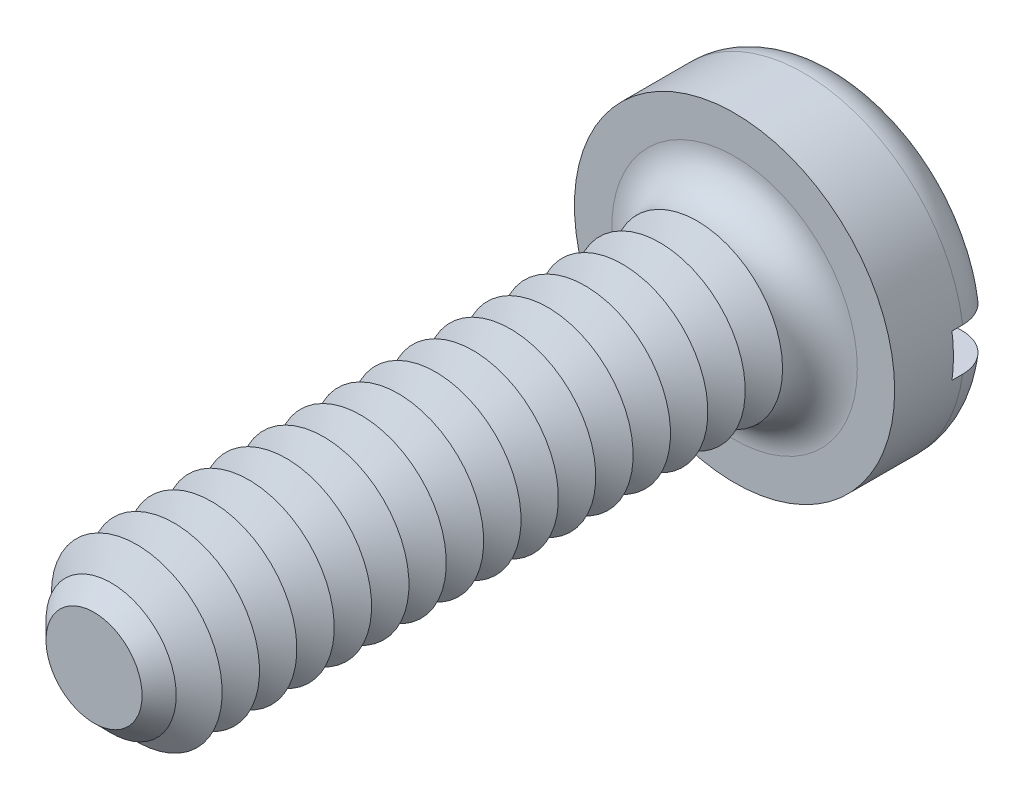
from build123d import *

# Parameters (mm, degrees)
SKETCH3_R           = 1.5
BOSS_EXTRUDE2_DEPTH = 1
SKETCH4_R           = 0.8
BOSS_EXTRUDE3_DEPTH = 6
FILLET1_R           = 0.35
CHAMFER1_SIZE       = 0.35
LPATTERN1_COUNT     = 16
LPATTERN1_PITCH     = 0.35
SKETCH8_W           = 3
SKETCH8_H           = 0.4
CUT_EXTRUDE1_DEPTH  = 0.45


with BuildPart() as part:
    # Sketch3 → Boss-Extrude2 (new body)
    with BuildSketch(Plane.XY):
        Circle(SKETCH3_R)
    extrude(amount=-BOSS_EXTRUDE2_DEPTH)

    # Sketch4 → Boss-Extrude3 (add)
    with BuildSketch(Plane.XY):
        Circle(SKETCH4_R)
    extrude(amount=BOSS_EXTRUDE3_DEPTH)

    # Fillet1
    fillet1_edges = [part.edges().sort_by_distance(p)[0] for p in [
        (-1.5, 0, -1),
        (-0.8, 0, 0),
    ]]
    fillet(fillet1_edges, radius=FILLET1_R)

    # Chamfer1
    chamfer1_edges = [part.edges().sort_by_distance(p)[0] for p in [
        (-0.8, 0, 6),
    ]]
    chamfer(chamfer1_edges, length=CHAMFER1_SIZE)

    # Sketch6 → Cut-Revolve1 (revolve, cut)
    with BuildSketch(Plane(origin=(0, 0, 0), x_dir=(0, 0, -1), z_dir=(1, 0, 0)), mode=Mode.PRIVATE) as cut_revolve1_sk:
        Polygon((-0.35, 0.8), (-0.525, 0.496891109), (-0.7, 0.8), align=None)
    cut_revolve1 = revolve(cut_revolve1_sk.sketch.rotate(Axis((0, 0, -1.694361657), (0, 0, 1)), 90), axis=Axis((0, 0, -1.694361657), (0, 0, 1)), mode=Mode.SUBTRACT)

    # LPattern1: Cut-Revolve1 ×16
    with Locations(*[(0, 0, i * LPATTERN1_PITCH) for i in range(1, LPATTERN1_COUNT)]):
        add(cut_revolve1, mode=Mode.SUBTRACT)

    # Sketch8 → Cut-Extrude1 (cut)
    with BuildSketch(Plane(origin=(0, 0, -1), x_dir=(-1, 0, 0), z_dir=(0, 0, -1))):
        Rectangle(SKETCH8_W, SKETCH8_H)
    extrude(amount=-CUT_EXTRUDE1_DEPTH, mode=Mode.SUBTRACT)


solid = part.part
